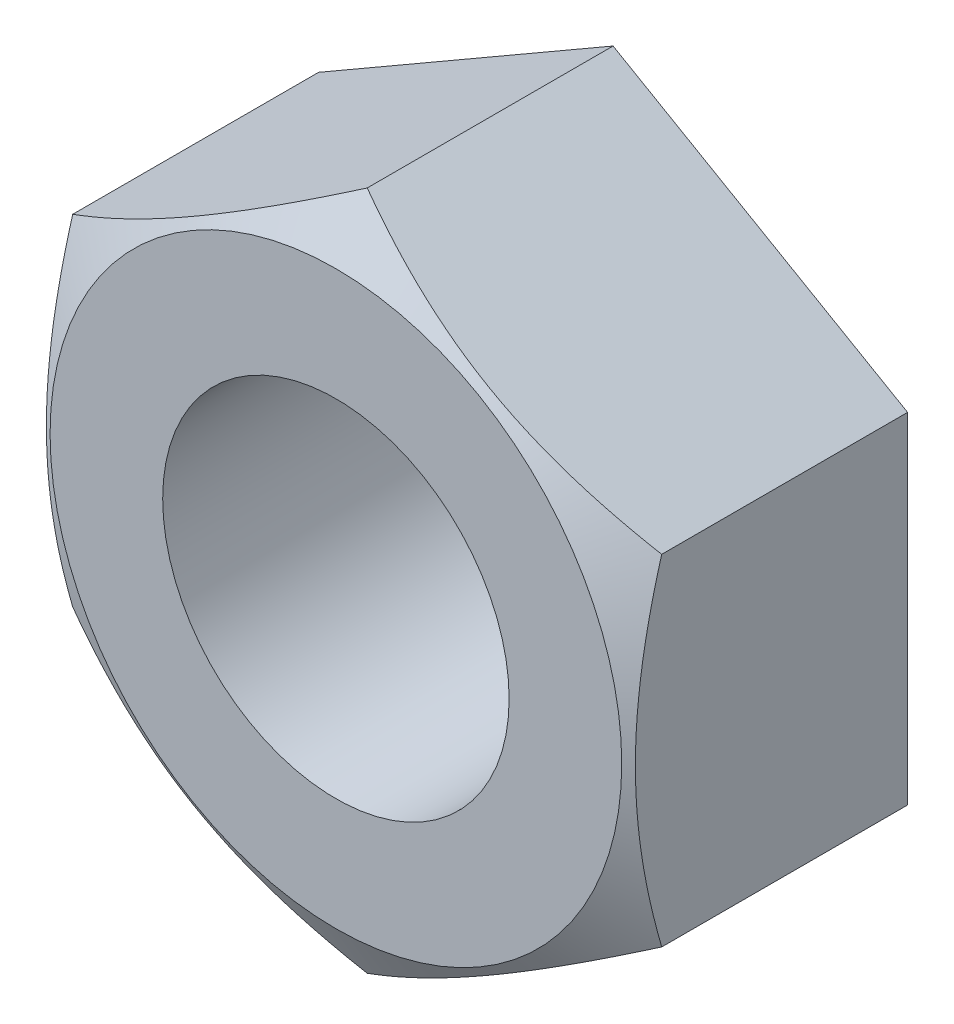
ISO-10303-21;
HEADER;
FILE_DESCRIPTION(('STEP AP214'),'2;1');
FILE_NAME('part.step','',(''),(''),'','','');
FILE_SCHEMA(('AUTOMOTIVE_DESIGN { 1 0 10303 214 1 1 1 1 }'));
ENDSEC;
DATA;
#1=APPLICATION_CONTEXT('core data for automotive mechanical design processes');
#2=APPLICATION_PROTOCOL_DEFINITION('international standard','automotive_design',2000,#1);
#3=PRODUCT_CONTEXT('',#1,'mechanical');
#4=PRODUCT('Part','Part','',(#3));
#5=PRODUCT_RELATED_PRODUCT_CATEGORY('part','',(#4));
#6=PRODUCT_DEFINITION_FORMATION('','',#4);
#7=PRODUCT_DEFINITION_CONTEXT('part definition',#1,'design');
#8=PRODUCT_DEFINITION('design','',#6,#7);
#9=PRODUCT_DEFINITION_SHAPE('','',#8);
#10=(LENGTH_UNIT() NAMED_UNIT(*) SI_UNIT(.MILLI.,.METRE.));
#11=(NAMED_UNIT(*) PLANE_ANGLE_UNIT() SI_UNIT($,.RADIAN.));
#12=(NAMED_UNIT(*) SI_UNIT($,.STERADIAN.) SOLID_ANGLE_UNIT());
#13=UNCERTAINTY_MEASURE_WITH_UNIT(LENGTH_MEASURE(1.E-05),#10,'distance_accuracy_value','');
#14=(GEOMETRIC_REPRESENTATION_CONTEXT(3) GLOBAL_UNCERTAINTY_ASSIGNED_CONTEXT((#13)) GLOBAL_UNIT_ASSIGNED_CONTEXT((#10,
#11,#12)) REPRESENTATION_CONTEXT('',''));
#15=CARTESIAN_POINT('',(0.,0.,0.));
#16=DIRECTION('',(0.,0.,1.));
#17=DIRECTION('',(1.,0.,0.));
#18=AXIS2_PLACEMENT_3D('',#15,#16,#17);
#19=CARTESIAN_POINT('',(-8.5,-4.90747728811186,8.));
#20=DIRECTION('',(0.5,0.866025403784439,0.));
#21=DIRECTION('',(-0.866025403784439,0.5,0.));
#22=AXIS2_PLACEMENT_3D('',#19,#20,#21);
#23=PLANE('',#22);
#24=DIRECTION('',(0.,0.,-1.));
#25=VECTOR('',#24,1.);
#26=CARTESIAN_POINT('',(0.,-9.81495457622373,8.));
#27=LINE('',#26,#25);
#28=CARTESIAN_POINT('',(0.,-9.81495457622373,7.09647305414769));
#29=VERTEX_POINT('',#28);
#30=CARTESIAN_POINT('',(0.,-9.81495457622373,0.));
#31=VERTEX_POINT('',#30);
#32=EDGE_CURVE('E9',#29,#31,#27,.T.);
#33=ORIENTED_EDGE('',*,*,#32,.F.);
#34=CARTESIAN_POINT('',(0.00019999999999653,-9.81507004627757,7.09640638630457));
#35=CARTESIAN_POINT('',(-0.186639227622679,-9.7071983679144,7.15867629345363));
#36=CARTESIAN_POINT('',(-0.374175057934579,-9.59892450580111,7.21812013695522));
#37=CARTESIAN_POINT('',(-0.750769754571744,-9.38149745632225,7.33057732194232));
#38=CARTESIAN_POINT('',(-0.939829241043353,-9.27234391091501,7.38358788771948));
#39=CARTESIAN_POINT('',(-1.51003475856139,-8.94313560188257,7.53192904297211));
#40=CARTESIAN_POINT('',(-1.89343164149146,-8.72178130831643,7.61630350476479));
#41=CARTESIAN_POINT('',(-2.46717766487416,-8.39052888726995,7.71524241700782));
#42=CARTESIAN_POINT('',(-2.65581276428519,-8.28162036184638,7.74342723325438));
#43=CARTESIAN_POINT('',(-3.03393602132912,-8.06331079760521,7.79068834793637));
#44=CARTESIAN_POINT('',(-3.22342410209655,-7.95390980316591,7.80976545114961));
#45=CARTESIAN_POINT('',(-3.60272652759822,-7.73491944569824,7.83832766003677));
#46=CARTESIAN_POINT('',(-3.7925402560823,-7.62533043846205,7.84782365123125));
#47=CARTESIAN_POINT('',(-4.17234305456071,-7.4060511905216,7.85702005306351));
#48=CARTESIAN_POINT('',(-4.36233211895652,-7.29636095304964,7.85672076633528));
#49=CARTESIAN_POINT('',(-4.71752301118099,-7.09129139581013,7.84700795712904));
#50=CARTESIAN_POINT('',(-4.88274990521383,-6.99589760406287,7.83877926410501));
#51=CARTESIAN_POINT('',(-5.21281671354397,-6.80533344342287,7.81507319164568));
#52=CARTESIAN_POINT('',(-5.37765660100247,-6.71016309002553,7.79959532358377));
#53=CARTESIAN_POINT('',(-5.87153810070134,-6.42502047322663,7.74265381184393));
#54=CARTESIAN_POINT('',(-6.19970550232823,-6.23555293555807,7.69068937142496));
#55=CARTESIAN_POINT('',(-6.85952142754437,-5.85460803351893,7.56077749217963));
#56=CARTESIAN_POINT('',(-7.19108574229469,-5.66317928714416,7.48227936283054));
#57=CARTESIAN_POINT('',(-7.84926989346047,-5.28317649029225,7.30412109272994));
#58=CARTESIAN_POINT('',(-8.17589815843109,-5.09459757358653,7.20450279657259));
#59=CARTESIAN_POINT('',(-8.5002,-4.90736181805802,7.09640638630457));
#60=B_SPLINE_CURVE_WITH_KNOTS('',3,(#34,#35,#36,#37,#38,#39,#40,#41,#42,#43,#44,#45,#46,#47,#48,
#49,#50,#51,#52,#53,#54,#55,#56,#57,#58,#59),.UNSPECIFIED.,.F.,.F.,(4,2,2,2,2,2,2,2,2,2,2,2,4),
(0.,0.673596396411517,1.34748239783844,2.69805431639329,3.35679995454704,4.01548737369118,
4.67342558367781,5.33134346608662,5.90409556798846,6.4768862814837,7.6232836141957,
8.7951056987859,9.96462743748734),.UNSPECIFIED.);
#61=CARTESIAN_POINT('',(-8.5,-4.90747728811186,7.09647305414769));
#62=VERTEX_POINT('',#61);
#63=EDGE_CURVE('E67',#29,#62,#60,.T.);
#64=ORIENTED_EDGE('',*,*,#63,.T.);
#65=DIRECTION('',(0.,0.,-1.));
#66=VECTOR('',#65,1.);
#67=CARTESIAN_POINT('',(-8.5,-4.90747728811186,8.));
#68=LINE('',#67,#66);
#69=CARTESIAN_POINT('',(-8.5,-4.90747728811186,0.));
#70=VERTEX_POINT('',#69);
#71=EDGE_CURVE('E37',#62,#70,#68,.T.);
#72=ORIENTED_EDGE('',*,*,#71,.T.);
#73=DIRECTION('',(0.866025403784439,-0.5,0.));
#74=VECTOR('',#73,1.);
#75=CARTESIAN_POINT('',(-8.5,-4.90747728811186,0.));
#76=LINE('',#75,#74);
#77=EDGE_CURVE('E74',#70,#31,#76,.T.);
#78=ORIENTED_EDGE('',*,*,#77,.T.);
#79=EDGE_LOOP('',(#33,#64,#72,#78));
#80=FACE_BOUND('',#79,.T.);
#81=ADVANCED_FACE('F14',(#80),#23,.F.);
#82=CARTESIAN_POINT('',(0.,-9.81495457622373,8.));
#83=DIRECTION('',(-0.5,0.866025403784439,0.));
#84=DIRECTION('',(-0.866025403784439,-0.5,0.));
#85=AXIS2_PLACEMENT_3D('',#82,#83,#84);
#86=PLANE('',#85);
#87=DIRECTION('',(0.,0.,-1.));
#88=VECTOR('',#87,1.);
#89=CARTESIAN_POINT('',(8.5,-4.90747728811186,8.));
#90=LINE('',#89,#88);
#91=CARTESIAN_POINT('',(8.5,-4.90747728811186,7.09647305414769));
#92=VERTEX_POINT('',#91);
#93=CARTESIAN_POINT('',(8.5,-4.90747728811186,0.));
#94=VERTEX_POINT('',#93);
#95=EDGE_CURVE('E22',#92,#94,#90,.T.);
#96=ORIENTED_EDGE('',*,*,#95,.F.);
#97=CARTESIAN_POINT('',(8.5002,-4.90736181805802,7.09640638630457));
#98=CARTESIAN_POINT('',(8.31336077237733,-5.01523349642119,7.15867629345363));
#99=CARTESIAN_POINT('',(8.12582494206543,-5.12350735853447,7.21812013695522));
#100=CARTESIAN_POINT('',(7.74923024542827,-5.34093440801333,7.3305773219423));
#101=CARTESIAN_POINT('',(7.56017075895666,-5.45008795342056,7.38358788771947));
#102=CARTESIAN_POINT('',(6.98996524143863,-5.77929626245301,7.5319290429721));
#103=CARTESIAN_POINT('',(6.60656835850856,-6.00065055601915,7.61630350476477));
#104=CARTESIAN_POINT('',(6.03282233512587,-6.33190297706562,7.7152424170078));
#105=CARTESIAN_POINT('',(5.84418723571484,-6.44081150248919,7.74342723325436));
#106=CARTESIAN_POINT('',(5.46606397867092,-6.65912106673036,7.79068834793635));
#107=CARTESIAN_POINT('',(5.27657589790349,-6.76852206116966,7.80976545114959));
#108=CARTESIAN_POINT('',(4.89727347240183,-6.98751241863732,7.83832766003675));
#109=CARTESIAN_POINT('',(4.70745974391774,-7.09710142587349,7.84782365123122));
#110=CARTESIAN_POINT('',(4.32765694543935,-7.31638067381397,7.8570200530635));
#111=CARTESIAN_POINT('',(4.13766788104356,-7.42607091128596,7.85672076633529));
#112=CARTESIAN_POINT('',(3.78247698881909,-7.63114046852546,7.84700795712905));
#113=CARTESIAN_POINT('',(3.61725009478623,-7.7265342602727,7.83877926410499));
#114=CARTESIAN_POINT('',(3.28718328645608,-7.91709842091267,7.81507319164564));
#115=CARTESIAN_POINT('',(3.12234339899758,-8.01226877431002,7.79959532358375));
#116=CARTESIAN_POINT('',(2.62846189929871,-8.29741139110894,7.74265381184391));
#117=CARTESIAN_POINT('',(2.30029449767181,-8.48687892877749,7.69068937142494));
#118=CARTESIAN_POINT('',(1.64047857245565,-8.86782383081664,7.5607774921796));
#119=CARTESIAN_POINT('',(1.30891425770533,-9.05925257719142,7.48227936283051));
#120=CARTESIAN_POINT('',(0.650730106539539,-9.43925537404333,7.30412109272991));
#121=CARTESIAN_POINT('',(0.324101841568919,-9.62783429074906,7.20450279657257));
#122=CARTESIAN_POINT('',(-0.000200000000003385,-9.81507004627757,7.09640638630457));
#123=B_SPLINE_CURVE_WITH_KNOTS('',3,(#97,#98,#99,#100,#101,#102,#103,#104,#105,#106,#107,#108,
#109,#110,#111,#112,#113,#114,#115,#116,#117,#118,#119,#120,#121,#122),.UNSPECIFIED.,.F.,.F.,(4,
2,2,2,2,2,2,2,2,2,2,2,4),(0.,0.673596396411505,1.34748239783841,2.69805431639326,
3.35679995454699,4.01548737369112,4.67342558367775,5.33134346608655,5.90409556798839,
6.47688628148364,7.62328361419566,8.79510569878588,9.96462743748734),.UNSPECIFIED.);
#124=EDGE_CURVE('E75',#92,#29,#123,.T.);
#125=ORIENTED_EDGE('',*,*,#124,.T.);
#126=ORIENTED_EDGE('',*,*,#32,.T.);
#127=DIRECTION('',(0.866025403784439,0.5,0.));
#128=VECTOR('',#127,1.);
#129=CARTESIAN_POINT('',(0.,-9.81495457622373,0.));
#130=LINE('',#129,#128);
#131=EDGE_CURVE('E104',#31,#94,#130,.T.);
#132=ORIENTED_EDGE('',*,*,#131,.T.);
#133=EDGE_LOOP('',(#96,#125,#126,#132));
#134=FACE_BOUND('',#133,.T.);
#135=ADVANCED_FACE('F105',(#134),#86,.F.);
#136=CARTESIAN_POINT('',(8.5,-4.90747728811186,8.));
#137=DIRECTION('',(-1.,0.,0.));
#138=DIRECTION('',(0.,-1.,0.));
#139=AXIS2_PLACEMENT_3D('',#136,#137,#138);
#140=PLANE('',#139);
#141=DIRECTION('',(0.,0.,-1.));
#142=VECTOR('',#141,1.);
#143=CARTESIAN_POINT('',(8.5,4.90747728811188,8.));
#144=LINE('',#143,#142);
#145=CARTESIAN_POINT('',(8.5,4.90747728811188,7.09647305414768));
#146=VERTEX_POINT('',#145);
#147=CARTESIAN_POINT('',(8.5,4.90747728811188,0.));
#148=VERTEX_POINT('',#147);
#149=EDGE_CURVE('E90',#146,#148,#144,.T.);
#150=ORIENTED_EDGE('',*,*,#149,.F.);
#151=CARTESIAN_POINT('',(8.5,-13.1137029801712,3.74059008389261));
#152=CARTESIAN_POINT('',(8.5,-12.7430195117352,3.92012874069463));
#153=CARTESIAN_POINT('',(8.5,-12.3714777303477,4.09792599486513));
#154=CARTESIAN_POINT('',(8.5,-11.6262208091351,4.4490568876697));
#155=CARTESIAN_POINT('',(8.5,-11.2525053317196,4.62238980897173));
#156=CARTESIAN_POINT('',(8.5,-10.5004857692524,4.96449794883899));
#157=CARTESIAN_POINT('',(8.5,-10.1221677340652,5.13324260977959));
#158=CARTESIAN_POINT('',(8.5,-9.36249865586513,5.46373427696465));
#159=CARTESIAN_POINT('',(8.5,-8.98114775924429,5.62548161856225));
#160=CARTESIAN_POINT('',(8.5,-8.20276475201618,5.94507289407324));
#161=CARTESIAN_POINT('',(8.5,-7.80561621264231,6.10263484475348));
#162=CARTESIAN_POINT('',(8.5,-7.00664853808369,6.40566744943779));
#163=CARTESIAN_POINT('',(8.5,-6.60482888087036,6.5511367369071));
#164=CARTESIAN_POINT('',(8.5,-5.79664930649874,6.82611447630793));
#165=CARTESIAN_POINT('',(8.5,-5.39030070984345,6.955655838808));
#166=CARTESIAN_POINT('',(8.5,-4.5717901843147,7.19457779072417));
#167=CARTESIAN_POINT('',(8.5,-4.15963015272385,7.30396480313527));
#168=CARTESIAN_POINT('',(8.5,-3.33146749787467,7.49669832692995));
#169=CARTESIAN_POINT('',(8.5,-2.91549802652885,7.58018341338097));
#170=CARTESIAN_POINT('',(8.5,-2.28781120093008,7.68233613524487));
#171=CARTESIAN_POINT('',(8.5,-2.07794421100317,7.71254263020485));
#172=CARTESIAN_POINT('',(8.5,-1.65719051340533,7.76466999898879));
#173=CARTESIAN_POINT('',(8.5,-1.4463039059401,7.78659167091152));
#174=CARTESIAN_POINT('',(8.5,-1.02651821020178,7.8214412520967));
#175=CARTESIAN_POINT('',(8.5,-0.817628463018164,7.83448125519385));
#176=CARTESIAN_POINT('',(8.5,-0.399485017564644,7.85172086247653));
#177=CARTESIAN_POINT('',(8.5,-0.190231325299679,7.85592061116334));
#178=CARTESIAN_POINT('',(8.5,0.228266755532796,7.85537968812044));
#179=CARTESIAN_POINT('',(8.5,0.437511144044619,7.8506389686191));
#180=CARTESIAN_POINT('',(8.5,0.855616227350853,7.83233177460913));
#181=CARTESIAN_POINT('',(8.5,1.06447690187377,7.81876484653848));
#182=CARTESIAN_POINT('',(8.5,1.56852669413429,7.77565760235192));
#183=CARTESIAN_POINT('',(8.5,1.8633552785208,7.74181335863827));
#184=CARTESIAN_POINT('',(8.5,2.45076513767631,7.65840013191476));
#185=CARTESIAN_POINT('',(8.5,2.7433460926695,7.60882895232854));
#186=CARTESIAN_POINT('',(8.5,3.6174163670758,7.43915865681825));
#187=CARTESIAN_POINT('',(8.5,4.19489445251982,7.2981355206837));
#188=CARTESIAN_POINT('',(8.5,5.05828531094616,7.05433511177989));
#189=CARTESIAN_POINT('',(8.5,5.34869512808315,6.96657401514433));
#190=CARTESIAN_POINT('',(8.5,5.92669288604,6.78212255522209));
#191=CARTESIAN_POINT('',(8.5,6.2142808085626,6.68543213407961));
#192=CARTESIAN_POINT('',(8.5,6.78672882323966,6.48465788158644));
#193=CARTESIAN_POINT('',(8.5,7.07158982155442,6.38057661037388));
#194=CARTESIAN_POINT('',(8.5,7.63896428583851,6.16622669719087));
#195=CARTESIAN_POINT('',(8.5,7.92147777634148,6.05595811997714));
#196=CARTESIAN_POINT('',(8.5,8.57582356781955,5.79361872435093));
#197=CARTESIAN_POINT('',(8.5,8.94687335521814,5.63959999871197));
#198=CARTESIAN_POINT('',(8.5,9.68592146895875,5.32438746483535));
#199=CARTESIAN_POINT('',(8.5,10.0539196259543,5.16319326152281));
#200=CARTESIAN_POINT('',(8.5,10.7874167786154,4.8350330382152));
#201=CARTESIAN_POINT('',(8.5,11.152915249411,4.66806584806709));
#202=CARTESIAN_POINT('',(8.5,11.881745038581,4.32949540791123));
#203=CARTESIAN_POINT('',(8.5,12.2450763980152,4.15789224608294));
#204=CARTESIAN_POINT('',(8.5,12.970293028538,3.81072167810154));
#205=CARTESIAN_POINT('',(8.5,13.3321764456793,3.6351504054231));
#206=CARTESIAN_POINT('',(8.5,14.0544067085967,3.28087257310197));
#207=CARTESIAN_POINT('',(8.5,14.4147535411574,3.10216598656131));
#208=CARTESIAN_POINT('',(8.5,15.4937602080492,2.56220327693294));
#209=CARTESIAN_POINT('',(8.5,16.2104752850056,2.19706122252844));
#210=CARTESIAN_POINT('',(8.5,17.582214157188,1.4893075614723));
#211=CARTESIAN_POINT('',(8.5,18.2375334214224,1.14726611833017));
#212=CARTESIAN_POINT('',(8.5,19.545724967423,0.458487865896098));
#213=CARTESIAN_POINT('',(8.50000000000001,20.1985971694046,0.111750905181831));
#214=CARTESIAN_POINT('',(8.50000000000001,21.5008909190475,-0.584492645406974));
#215=CARTESIAN_POINT('',(8.50000000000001,22.1503169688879,-0.933990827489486));
#216=CARTESIAN_POINT('',(8.50000000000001,23.4475970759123,-1.63581347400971));
#217=CARTESIAN_POINT('',(8.5,24.0954512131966,-1.98813779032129));
#218=CARTESIAN_POINT('',(8.5,24.742723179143,-2.3415212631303));
#219=B_SPLINE_CURVE_WITH_KNOTS('',3,(#151,#152,#153,#154,#155,#156,#157,#158,#159,#160,#161,
#162,#163,#164,#165,#166,#167,#168,#169,#170,#171,#172,#173,#174,#175,#176,#177,#178,#179,#180,
#181,#182,#183,#184,#185,#186,#187,#188,#189,#190,#191,#192,#193,#194,#195,#196,#197,#198,#199,
#200,#201,#202,#203,#204,#205,#206,#207,#208,#209,#210,#211,#212,#213,#214,#215,#216,#217,#218),
.UNSPECIFIED.,.F.,.F.,(4,2,2,2,2,2,2,2,2,2,2,2,2,2,2,2,2,2,2,2,2,2,2,2,2,2,2,2,2,2,2,2,2,4),(0.,
1.23563804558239,2.47147341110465,3.71415303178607,4.95677302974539,6.23840597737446,
7.52018355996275,8.79926654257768,10.07794118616,11.3496520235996,11.9856032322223,
12.6214931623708,13.2492010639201,13.8768987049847,14.5045997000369,15.1323329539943,
16.0221230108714,16.9120373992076,18.6928822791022,19.6029510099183,20.5130256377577,
21.4227865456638,22.3325379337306,23.5376750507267,24.7428786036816,25.9483278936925,
27.1537542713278,28.3604106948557,29.5670774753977,31.9801143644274,34.1977326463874,
36.4154226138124,38.6279089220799,40.8402800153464),.UNSPECIFIED.);
#220=EDGE_CURVE('E101',#146,#92,#219,.F.);
#221=ORIENTED_EDGE('',*,*,#220,.T.);
#222=ORIENTED_EDGE('',*,*,#95,.T.);
#223=DIRECTION('',(0.,1.,0.));
#224=VECTOR('',#223,1.);
#225=CARTESIAN_POINT('',(8.5,-4.90747728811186,0.));
#226=LINE('',#225,#224);
#227=EDGE_CURVE('E99',#94,#148,#226,.T.);
#228=ORIENTED_EDGE('',*,*,#227,.T.);
#229=EDGE_LOOP('',(#150,#221,#222,#228));
#230=FACE_BOUND('',#229,.T.);
#231=ADVANCED_FACE('F97',(#230),#140,.F.);
#232=CARTESIAN_POINT('',(8.5,4.90747728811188,8.));
#233=DIRECTION('',(-0.5,-0.866025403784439,0.));
#234=DIRECTION('',(0.866025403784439,-0.5,0.));
#235=AXIS2_PLACEMENT_3D('',#232,#233,#234);
#236=PLANE('',#235);
#237=DIRECTION('',(0.,0.,-1.));
#238=VECTOR('',#237,1.);
#239=CARTESIAN_POINT('',(0.,9.81495457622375,8.));
#240=LINE('',#239,#238);
#241=CARTESIAN_POINT('',(0.,9.81495457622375,7.09647305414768));
#242=VERTEX_POINT('',#241);
#243=CARTESIAN_POINT('',(0.,9.81495457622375,0.));
#244=VERTEX_POINT('',#243);
#245=EDGE_CURVE('E83',#242,#244,#240,.T.);
#246=ORIENTED_EDGE('',*,*,#245,.F.);
#247=CARTESIAN_POINT('',(-0.00019999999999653,9.81507004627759,7.09640638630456));
#248=CARTESIAN_POINT('',(0.18663922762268,9.70719836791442,7.15867629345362));
#249=CARTESIAN_POINT('',(0.374175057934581,9.59892450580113,7.21812013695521));
#250=CARTESIAN_POINT('',(0.750769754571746,9.38149745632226,7.3305773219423));
#251=CARTESIAN_POINT('',(0.939829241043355,9.27234391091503,7.38358788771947));
#252=CARTESIAN_POINT('',(1.5100347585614,8.94313560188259,7.5319290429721));
#253=CARTESIAN_POINT('',(1.89343164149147,8.72178130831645,7.61630350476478));
#254=CARTESIAN_POINT('',(2.46717766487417,8.39052888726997,7.71524241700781));
#255=CARTESIAN_POINT('',(2.65581276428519,8.28162036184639,7.74342723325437));
#256=CARTESIAN_POINT('',(3.03393602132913,8.06331079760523,7.79068834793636));
#257=CARTESIAN_POINT('',(3.22342410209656,7.95390980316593,7.8097654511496));
#258=CARTESIAN_POINT('',(3.60272652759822,7.73491944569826,7.83832766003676));
#259=CARTESIAN_POINT('',(3.79254025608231,7.62533043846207,7.84782365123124));
#260=CARTESIAN_POINT('',(4.17234305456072,7.40605119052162,7.85702005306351));
#261=CARTESIAN_POINT('',(4.36233211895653,7.29636095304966,7.85672076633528));
#262=CARTESIAN_POINT('',(4.717523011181,7.09129139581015,7.84700795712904));
#263=CARTESIAN_POINT('',(4.88274990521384,6.99589760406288,7.838779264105));
#264=CARTESIAN_POINT('',(5.21281671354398,6.80533344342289,7.81507319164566));
#265=CARTESIAN_POINT('',(5.37765660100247,6.71016309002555,7.79959532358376));
#266=CARTESIAN_POINT('',(5.87153810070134,6.42502047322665,7.74265381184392));
#267=CARTESIAN_POINT('',(6.19970550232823,6.23555293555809,7.69068937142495));
#268=CARTESIAN_POINT('',(6.85952142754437,5.85460803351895,7.56077749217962));
#269=CARTESIAN_POINT('',(7.19108574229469,5.66317928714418,7.48227936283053));
#270=CARTESIAN_POINT('',(7.84926989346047,5.28317649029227,7.30412109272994));
#271=CARTESIAN_POINT('',(8.17589815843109,5.09459757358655,7.20450279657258));
#272=CARTESIAN_POINT('',(8.5002,4.90736181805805,7.09640638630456));
#273=B_SPLINE_CURVE_WITH_KNOTS('',3,(#247,#248,#249,#250,#251,#252,#253,#254,#255,#256,#257,
#258,#259,#260,#261,#262,#263,#264,#265,#266,#267,#268,#269,#270,#271,#272),.UNSPECIFIED.,.F.,
.F.,(4,2,2,2,2,2,2,2,2,2,2,2,4),(0.,0.673596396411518,1.34748239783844,2.6980543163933,
3.35679995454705,4.01548737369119,4.67342558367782,5.33134346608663,5.90409556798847,
6.4768862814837,7.6232836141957,8.7951056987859,9.96462743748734),.UNSPECIFIED.);
#274=EDGE_CURVE('E156',#242,#146,#273,.T.);
#275=ORIENTED_EDGE('',*,*,#274,.T.);
#276=ORIENTED_EDGE('',*,*,#149,.T.);
#277=DIRECTION('',(-0.866025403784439,0.5,0.));
#278=VECTOR('',#277,1.);
#279=CARTESIAN_POINT('',(8.5,4.90747728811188,0.));
#280=LINE('',#279,#278);
#281=EDGE_CURVE('E111',#148,#244,#280,.T.);
#282=ORIENTED_EDGE('',*,*,#281,.T.);
#283=EDGE_LOOP('',(#246,#275,#276,#282));
#284=FACE_BOUND('',#283,.T.);
#285=ADVANCED_FACE('F169',(#284),#236,.F.);
#286=CARTESIAN_POINT('',(0.,9.81495457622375,8.));
#287=DIRECTION('',(0.5,-0.866025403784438,0.));
#288=DIRECTION('',(0.866025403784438,0.5,0.));
#289=AXIS2_PLACEMENT_3D('',#286,#287,#288);
#290=PLANE('',#289);
#291=DIRECTION('',(0.,0.,-1.));
#292=VECTOR('',#291,1.);
#293=CARTESIAN_POINT('',(-8.5,4.90747728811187,8.));
#294=LINE('',#293,#292);
#295=CARTESIAN_POINT('',(-8.5,4.90747728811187,7.09647305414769));
#296=VERTEX_POINT('',#295);
#297=CARTESIAN_POINT('',(-8.5,4.90747728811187,0.));
#298=VERTEX_POINT('',#297);
#299=EDGE_CURVE('E81',#296,#298,#294,.T.);
#300=ORIENTED_EDGE('',*,*,#299,.F.);
#301=CARTESIAN_POINT('',(-8.5002,4.90736181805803,7.09640638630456));
#302=CARTESIAN_POINT('',(-8.31336077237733,5.0152334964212,7.15867629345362));
#303=CARTESIAN_POINT('',(-8.12582494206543,5.12350735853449,7.21812013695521));
#304=CARTESIAN_POINT('',(-7.74923024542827,5.34093440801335,7.3305773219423));
#305=CARTESIAN_POINT('',(-7.56017075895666,5.45008795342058,7.38358788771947));
#306=CARTESIAN_POINT('',(-6.98996524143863,5.77929626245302,7.53192904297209));
#307=CARTESIAN_POINT('',(-6.60656835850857,6.00065055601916,7.61630350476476));
#308=CARTESIAN_POINT('',(-6.03282233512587,6.33190297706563,7.71524241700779));
#309=CARTESIAN_POINT('',(-5.84418723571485,6.4408115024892,7.74342723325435));
#310=CARTESIAN_POINT('',(-5.46606397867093,6.65912106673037,7.79068834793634));
#311=CARTESIAN_POINT('',(-5.27657589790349,6.76852206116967,7.80976545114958));
#312=CARTESIAN_POINT('',(-4.89727347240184,6.98751241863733,7.83832766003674));
#313=CARTESIAN_POINT('',(-4.70745974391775,7.09710142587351,7.84782365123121));
#314=CARTESIAN_POINT('',(-4.32765694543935,7.31638067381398,7.85702005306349));
#315=CARTESIAN_POINT('',(-4.13766788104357,7.42607091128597,7.85672076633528));
#316=CARTESIAN_POINT('',(-3.78247698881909,7.63114046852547,7.84700795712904));
#317=CARTESIAN_POINT('',(-3.61725009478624,7.72653426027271,7.83877926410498));
#318=CARTESIAN_POINT('',(-3.28718328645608,7.91709842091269,7.81507319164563));
#319=CARTESIAN_POINT('',(-3.12234339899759,8.01226877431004,7.79959532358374));
#320=CARTESIAN_POINT('',(-2.62846189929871,8.29741139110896,7.7426538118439));
#321=CARTESIAN_POINT('',(-2.30029449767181,8.48687892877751,7.69068937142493));
#322=CARTESIAN_POINT('',(-1.64047857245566,8.86782383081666,7.56077749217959));
#323=CARTESIAN_POINT('',(-1.30891425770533,9.05925257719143,7.4822793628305));
#324=CARTESIAN_POINT('',(-0.65073010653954,9.43925537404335,7.3041210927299));
#325=CARTESIAN_POINT('',(-0.324101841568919,9.62783429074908,7.20450279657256));
#326=CARTESIAN_POINT('',(0.000200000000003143,9.81507004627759,7.09640638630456));
#327=B_SPLINE_CURVE_WITH_KNOTS('',3,(#301,#302,#303,#304,#305,#306,#307,#308,#309,#310,#311,
#312,#313,#314,#315,#316,#317,#318,#319,#320,#321,#322,#323,#324,#325,#326),.UNSPECIFIED.,.F.,
.F.,(4,2,2,2,2,2,2,2,2,2,2,2,4),(0.,0.673596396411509,1.34748239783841,2.69805431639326,
3.35679995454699,4.01548737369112,4.67342558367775,5.33134346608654,5.90409556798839,
6.47688628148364,7.62328361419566,8.79510569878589,9.96462743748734),.UNSPECIFIED.);
#328=EDGE_CURVE('E29',#296,#242,#327,.T.);
#329=ORIENTED_EDGE('',*,*,#328,.T.);
#330=ORIENTED_EDGE('',*,*,#245,.T.);
#331=DIRECTION('',(-0.866025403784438,-0.5,0.));
#332=VECTOR('',#331,1.);
#333=CARTESIAN_POINT('',(0.,9.81495457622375,0.));
#334=LINE('',#333,#332);
#335=EDGE_CURVE('E85',#244,#298,#334,.T.);
#336=ORIENTED_EDGE('',*,*,#335,.T.);
#337=EDGE_LOOP('',(#300,#329,#330,#336));
#338=FACE_BOUND('',#337,.T.);
#339=ADVANCED_FACE('F117',(#338),#290,.F.);
#340=CARTESIAN_POINT('',(-8.5,4.90747728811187,8.));
#341=DIRECTION('',(1.,0.,0.));
#342=DIRECTION('',(0.,0.,-1.));
#343=AXIS2_PLACEMENT_3D('',#340,#341,#342);
#344=PLANE('',#343);
#345=ORIENTED_EDGE('',*,*,#71,.F.);
#346=CARTESIAN_POINT('',(-8.5,-13.1137029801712,3.74059008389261));
#347=CARTESIAN_POINT('',(-8.5,-12.7430195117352,3.92012874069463));
#348=CARTESIAN_POINT('',(-8.5,-12.3714777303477,4.09792599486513));
#349=CARTESIAN_POINT('',(-8.5,-11.6262208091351,4.4490568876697));
#350=CARTESIAN_POINT('',(-8.5,-11.2525053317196,4.62238980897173));
#351=CARTESIAN_POINT('',(-8.5,-10.5004857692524,4.96449794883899));
#352=CARTESIAN_POINT('',(-8.5,-10.1221677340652,5.13324260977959));
#353=CARTESIAN_POINT('',(-8.5,-9.36249865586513,5.46373427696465));
#354=CARTESIAN_POINT('',(-8.5,-8.98114775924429,5.62548161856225));
#355=CARTESIAN_POINT('',(-8.5,-8.20276475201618,5.94507289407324));
#356=CARTESIAN_POINT('',(-8.5,-7.80561621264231,6.10263484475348));
#357=CARTESIAN_POINT('',(-8.5,-7.00664853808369,6.40566744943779));
#358=CARTESIAN_POINT('',(-8.5,-6.60482888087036,6.5511367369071));
#359=CARTESIAN_POINT('',(-8.5,-5.79664930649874,6.82611447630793));
#360=CARTESIAN_POINT('',(-8.5,-5.39030070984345,6.955655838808));
#361=CARTESIAN_POINT('',(-8.5,-4.5717901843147,7.19457779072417));
#362=CARTESIAN_POINT('',(-8.5,-4.15963015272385,7.30396480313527));
#363=CARTESIAN_POINT('',(-8.5,-3.33146749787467,7.49669832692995));
#364=CARTESIAN_POINT('',(-8.5,-2.91549802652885,7.58018341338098));
#365=CARTESIAN_POINT('',(-8.5,-2.28781120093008,7.68233613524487));
#366=CARTESIAN_POINT('',(-8.5,-2.07794421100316,7.71254263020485));
#367=CARTESIAN_POINT('',(-8.5,-1.65719051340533,7.76466999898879));
#368=CARTESIAN_POINT('',(-8.5,-1.4463039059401,7.78659167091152));
#369=CARTESIAN_POINT('',(-8.5,-1.02651821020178,7.8214412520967));
#370=CARTESIAN_POINT('',(-8.5,-0.817628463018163,7.83448125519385));
#371=CARTESIAN_POINT('',(-8.5,-0.399485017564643,7.85172086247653));
#372=CARTESIAN_POINT('',(-8.5,-0.190231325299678,7.85592061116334));
#373=CARTESIAN_POINT('',(-8.5,0.228266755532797,7.85537968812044));
#374=CARTESIAN_POINT('',(-8.5,0.437511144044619,7.8506389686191));
#375=CARTESIAN_POINT('',(-8.5,0.855616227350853,7.83233177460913));
#376=CARTESIAN_POINT('',(-8.5,1.06447690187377,7.81876484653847));
#377=CARTESIAN_POINT('',(-8.5,1.56852669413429,7.77565760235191));
#378=CARTESIAN_POINT('',(-8.5,1.8633552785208,7.74181335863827));
#379=CARTESIAN_POINT('',(-8.5,2.45076513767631,7.65840013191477));
#380=CARTESIAN_POINT('',(-8.5,2.74334609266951,7.60882895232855));
#381=CARTESIAN_POINT('',(-8.5,3.61741636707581,7.43915865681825));
#382=CARTESIAN_POINT('',(-8.5,4.19489445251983,7.2981355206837));
#383=CARTESIAN_POINT('',(-8.5,5.05828531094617,7.05433511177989));
#384=CARTESIAN_POINT('',(-8.5,5.34869512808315,6.96657401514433));
#385=CARTESIAN_POINT('',(-8.5,5.92669288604,6.78212255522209));
#386=CARTESIAN_POINT('',(-8.5,6.2142808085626,6.68543213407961));
#387=CARTESIAN_POINT('',(-8.5,6.78672882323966,6.48465788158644));
#388=CARTESIAN_POINT('',(-8.5,7.07158982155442,6.38057661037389));
#389=CARTESIAN_POINT('',(-8.5,7.63896428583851,6.16622669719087));
#390=CARTESIAN_POINT('',(-8.5,7.92147777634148,6.05595811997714));
#391=CARTESIAN_POINT('',(-8.5,8.57582356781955,5.79361872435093));
#392=CARTESIAN_POINT('',(-8.5,8.94687335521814,5.63959999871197));
#393=CARTESIAN_POINT('',(-8.5,9.68592146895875,5.32438746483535));
#394=CARTESIAN_POINT('',(-8.5,10.0539196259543,5.16319326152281));
#395=CARTESIAN_POINT('',(-8.5,10.7874167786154,4.83503303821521));
#396=CARTESIAN_POINT('',(-8.5,11.152915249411,4.66806584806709));
#397=CARTESIAN_POINT('',(-8.5,11.881745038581,4.32949540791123));
#398=CARTESIAN_POINT('',(-8.5,12.2450763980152,4.15789224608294));
#399=CARTESIAN_POINT('',(-8.5,12.970293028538,3.81072167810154));
#400=CARTESIAN_POINT('',(-8.5,13.3321764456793,3.63515040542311));
#401=CARTESIAN_POINT('',(-8.5,14.0544067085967,3.28087257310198));
#402=CARTESIAN_POINT('',(-8.5,14.4147535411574,3.10216598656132));
#403=CARTESIAN_POINT('',(-8.5,15.4937602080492,2.56220327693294));
#404=CARTESIAN_POINT('',(-8.5,16.2104752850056,2.19706122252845));
#405=CARTESIAN_POINT('',(-8.5,17.582214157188,1.4893075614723));
#406=CARTESIAN_POINT('',(-8.5,18.2375334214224,1.14726611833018));
#407=CARTESIAN_POINT('',(-8.5,19.545724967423,0.458487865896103));
#408=CARTESIAN_POINT('',(-8.5,20.1985971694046,0.111750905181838));
#409=CARTESIAN_POINT('',(-8.5,21.5008909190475,-0.584492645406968));
#410=CARTESIAN_POINT('',(-8.5,22.1503169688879,-0.933990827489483));
#411=CARTESIAN_POINT('',(-8.5,23.4475970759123,-1.63581347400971));
#412=CARTESIAN_POINT('',(-8.5,24.0954512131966,-1.98813779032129));
#413=CARTESIAN_POINT('',(-8.5,24.742723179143,-2.34152126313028));
#414=B_SPLINE_CURVE_WITH_KNOTS('',3,(#346,#347,#348,#349,#350,#351,#352,#353,#354,#355,#356,
#357,#358,#359,#360,#361,#362,#363,#364,#365,#366,#367,#368,#369,#370,#371,#372,#373,#374,#375,
#376,#377,#378,#379,#380,#381,#382,#383,#384,#385,#386,#387,#388,#389,#390,#391,#392,#393,#394,
#395,#396,#397,#398,#399,#400,#401,#402,#403,#404,#405,#406,#407,#408,#409,#410,#411,#412,#413),
.UNSPECIFIED.,.F.,.F.,(4,2,2,2,2,2,2,2,2,2,2,2,2,2,2,2,2,2,2,2,2,2,2,2,2,2,2,2,2,2,2,2,2,4),(0.,
1.23563804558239,2.47147341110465,3.71415303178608,4.95677302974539,6.23840597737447,
7.52018355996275,8.79926654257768,10.07794118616,11.3496520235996,11.9856032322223,
12.6214931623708,13.2492010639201,13.8768987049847,14.5045997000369,15.1323329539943,
16.0221230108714,16.9120373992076,18.6928822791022,19.6029510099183,20.5130256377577,
21.4227865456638,22.3325379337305,23.5376750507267,24.7428786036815,25.9483278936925,
27.1537542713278,28.3604106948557,29.5670774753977,31.9801143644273,34.1977326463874,
36.4154226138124,38.6279089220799,40.8402800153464),.UNSPECIFIED.);
#415=EDGE_CURVE('E65',#62,#296,#414,.T.);
#416=ORIENTED_EDGE('',*,*,#415,.T.);
#417=ORIENTED_EDGE('',*,*,#299,.T.);
#418=DIRECTION('',(0.,-1.,0.));
#419=VECTOR('',#418,1.);
#420=CARTESIAN_POINT('',(-8.5,4.90747728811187,0.));
#421=LINE('',#420,#419);
#422=EDGE_CURVE('E79',#298,#70,#421,.T.);
#423=ORIENTED_EDGE('',*,*,#422,.T.);
#424=EDGE_LOOP('',(#345,#416,#417,#423));
#425=FACE_BOUND('',#424,.T.);
#426=ADVANCED_FACE('F77',(#425),#344,.F.);
#427=CARTESIAN_POINT('',(-17.,0.,0.));
#428=DIRECTION('',(0.,0.,-1.));
#429=DIRECTION('',(-1.,0.,0.));
#430=AXIS2_PLACEMENT_3D('',#427,#428,#429);
#431=PLANE('',#430);
#432=CARTESIAN_POINT('',(0.,0.,0.));
#433=DIRECTION('',(0.,0.,-1.));
#434=DIRECTION('',(-1.,0.,0.));
#435=AXIS2_PLACEMENT_3D('',#432,#433,#434);
#436=CIRCLE('',#435,5.);
#437=CARTESIAN_POINT('',(-5.,0.,0.));
#438=VERTEX_POINT('',#437);
#439=EDGE_CURVE('E248',#438,#438,#436,.T.);
#440=ORIENTED_EDGE('',*,*,#439,.F.);
#441=EDGE_LOOP('',(#440));
#442=FACE_BOUND('',#441,.T.);
#443=ORIENTED_EDGE('',*,*,#77,.F.);
#444=ORIENTED_EDGE('',*,*,#422,.F.);
#445=ORIENTED_EDGE('',*,*,#335,.F.);
#446=ORIENTED_EDGE('',*,*,#281,.F.);
#447=ORIENTED_EDGE('',*,*,#227,.F.);
#448=ORIENTED_EDGE('',*,*,#131,.F.);
#449=EDGE_LOOP('',(#443,#444,#445,#446,#447,#448));
#450=FACE_BOUND('',#449,.T.);
#451=ADVANCED_FACE('F108',(#442,#450),#431,.T.);
#452=CARTESIAN_POINT('',(0.,0.,8.));
#453=DIRECTION('',(0.,0.,-1.));
#454=DIRECTION('',(-1.,0.,0.));
#455=AXIS2_PLACEMENT_3D('',#452,#453,#454);
#456=CONICAL_SURFACE('',#455,8.25,1.0471975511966);
#457=CARTESIAN_POINT('',(0.,0.,8.));
#458=DIRECTION('',(0.,0.,-1.));
#459=DIRECTION('',(-1.,0.,0.));
#460=AXIS2_PLACEMENT_3D('',#457,#458,#459);
#461=CIRCLE('',#460,8.25);
#462=CARTESIAN_POINT('',(-8.25,0.,8.));
#463=VERTEX_POINT('',#462);
#464=EDGE_CURVE('E71',#463,#463,#461,.T.);
#465=ORIENTED_EDGE('',*,*,#464,.T.);
#466=EDGE_LOOP('',(#465));
#467=FACE_BOUND('',#466,.T.);
#468=ORIENTED_EDGE('',*,*,#124,.F.);
#469=ORIENTED_EDGE('',*,*,#220,.F.);
#470=ORIENTED_EDGE('',*,*,#274,.F.);
#471=ORIENTED_EDGE('',*,*,#328,.F.);
#472=ORIENTED_EDGE('',*,*,#415,.F.);
#473=ORIENTED_EDGE('',*,*,#63,.F.);
#474=EDGE_LOOP('',(#468,#469,#470,#471,#472,#473));
#475=FACE_BOUND('',#474,.T.);
#476=ADVANCED_FACE('F66',(#467,#475),#456,.T.);
#477=CARTESIAN_POINT('',(-17.,0.,8.));
#478=DIRECTION('',(0.,0.,-1.));
#479=DIRECTION('',(-1.,0.,0.));
#480=AXIS2_PLACEMENT_3D('',#477,#478,#479);
#481=PLANE('',#480);
#482=CARTESIAN_POINT('',(0.,0.,8.));
#483=DIRECTION('',(0.,0.,-1.));
#484=DIRECTION('',(-1.,0.,0.));
#485=AXIS2_PLACEMENT_3D('',#482,#483,#484);
#486=CIRCLE('',#485,5.);
#487=CARTESIAN_POINT('',(-5.,0.,8.));
#488=VERTEX_POINT('',#487);
#489=EDGE_CURVE('E245',#488,#488,#486,.T.);
#490=ORIENTED_EDGE('',*,*,#489,.T.);
#491=EDGE_LOOP('',(#490));
#492=FACE_BOUND('',#491,.T.);
#493=ORIENTED_EDGE('',*,*,#464,.F.);
#494=EDGE_LOOP('',(#493));
#495=FACE_BOUND('',#494,.T.);
#496=ADVANCED_FACE('F134',(#492,#495),#481,.F.);
#497=CARTESIAN_POINT('',(0.,0.,8.));
#498=DIRECTION('',(0.,0.,-1.));
#499=DIRECTION('',(-1.,0.,0.));
#500=AXIS2_PLACEMENT_3D('',#497,#498,#499);
#501=CYLINDRICAL_SURFACE('',#500,5.);
#502=ORIENTED_EDGE('',*,*,#489,.F.);
#503=EDGE_LOOP('',(#502));
#504=FACE_BOUND('',#503,.T.);
#505=ORIENTED_EDGE('',*,*,#439,.T.);
#506=EDGE_LOOP('',(#505));
#507=FACE_BOUND('',#506,.T.);
#508=ADVANCED_FACE('F136',(#504,#507),#501,.F.);
#509=CLOSED_SHELL('',(#81,#135,#231,#285,#339,#426,#451,#476,#496,#508));
#510=MANIFOLD_SOLID_BREP('B1',#509);
#511=ADVANCED_BREP_SHAPE_REPRESENTATION('',(#18,#510),#14);
#512=SHAPE_DEFINITION_REPRESENTATION(#9,#511);
ENDSEC;
END-ISO-10303-21;
